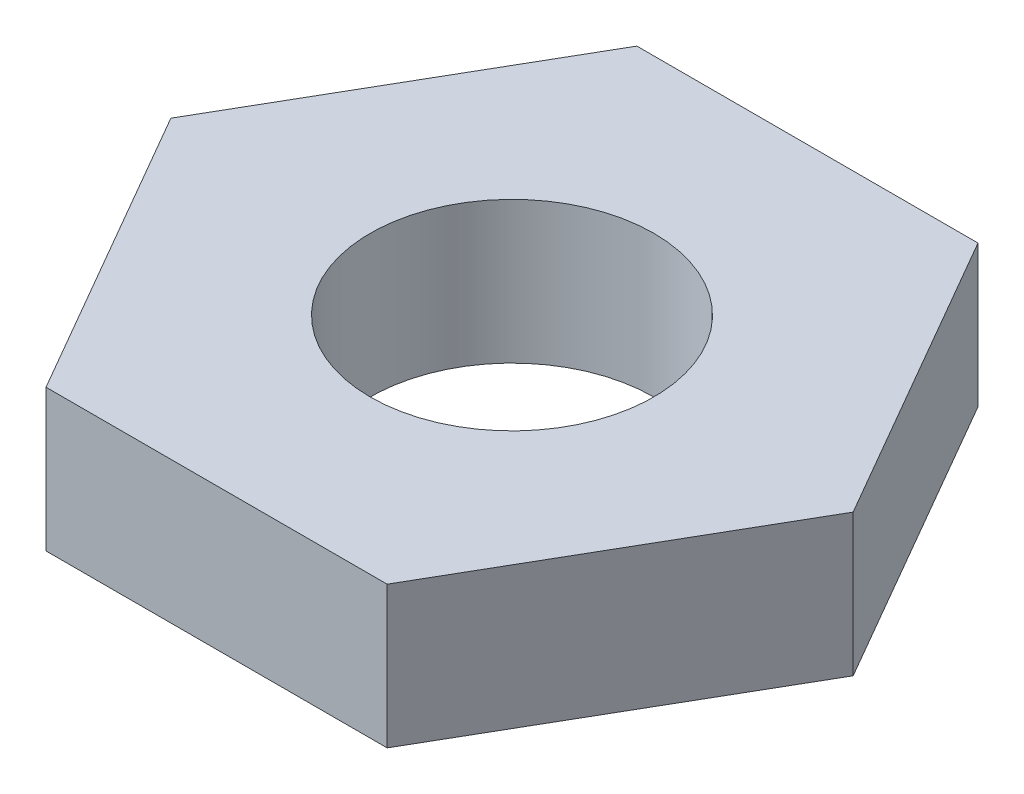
from build123d import *

# Parameters (mm, degrees)
SKETCH1_R      = 6
EXTRUDE1_DEPTH = 6


with BuildPart() as part:
    # Sketch1 → Extrude1 (new body)
    with BuildSketch(Plane(origin=(0, 0, 0), x_dir=(1, 0, 0), z_dir=(0, 1, 0))):
        Polygon((14.43375673, 0), (7.216878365, 12.5), (-7.216878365, 12.5), (-14.43375673, 0), (-7.216878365, -12.5), (7.216878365, -12.5), align=None)
        with Locations(Location((0, 0, 0), (0, 0, 270))):
            Circle(SKETCH1_R, mode=Mode.SUBTRACT)
    extrude(amount=EXTRUDE1_DEPTH)


solid = part.part
